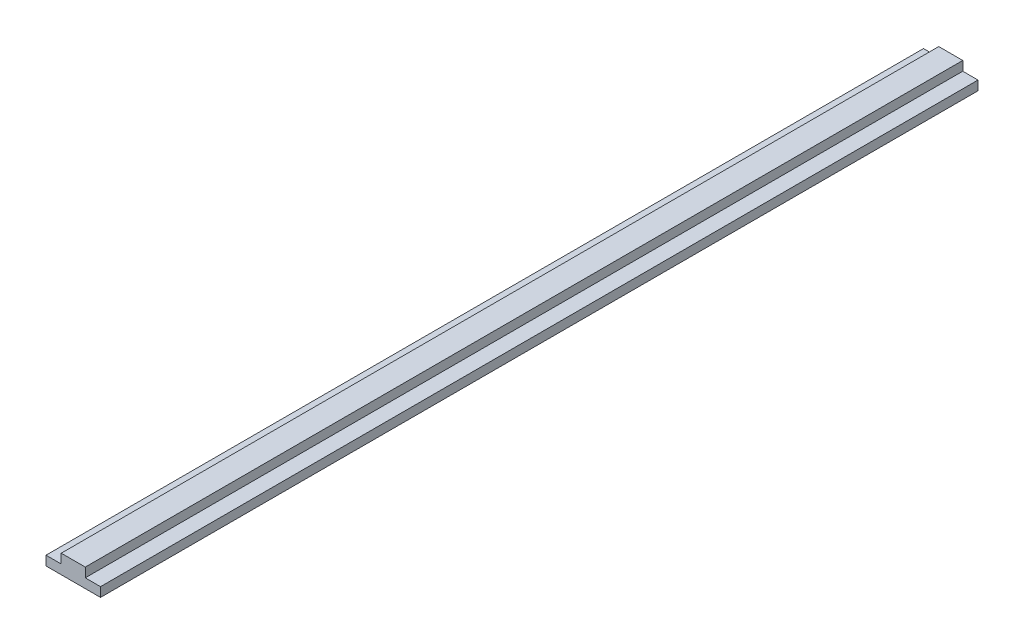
from build123d import *

# Parameters (mm, degrees)
BOSS_EXTRUDE2_DEPTH = 25
SKETCH6_W           = 20.38466305
SKETCH6_H           = 1174
CUT_EXTRUDE1_DEPTH  = 12.5


with BuildPart() as part:
    # Sketch5 → Boss-Extrude2 (new body)
    with BuildSketch(Plane(origin=(0, 0, 0), x_dir=(1, 0, 0), z_dir=(0, 1, 0))):
        Polygon((0, 0), (36.459952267, 0), (36.459952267, -1174), (-36.459952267, -1174), (-36.459952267, 0), align=None)
    extrude(amount=BOSS_EXTRUDE2_DEPTH)

    # Sketch6 → Cut-Extrude1 (cut)
    with BuildSketch(Plane(origin=(0, 25, 0), x_dir=(1, 0, 0), z_dir=(0, 1, 0))):
        with Locations((-26.267620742, -587)):
            Rectangle(SKETCH6_W, SKETCH6_H)
        with Locations((26.267620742, -587)):
            Rectangle(SKETCH6_W, SKETCH6_H)
    extrude(amount=-CUT_EXTRUDE1_DEPTH, mode=Mode.SUBTRACT)


solid = part.part
